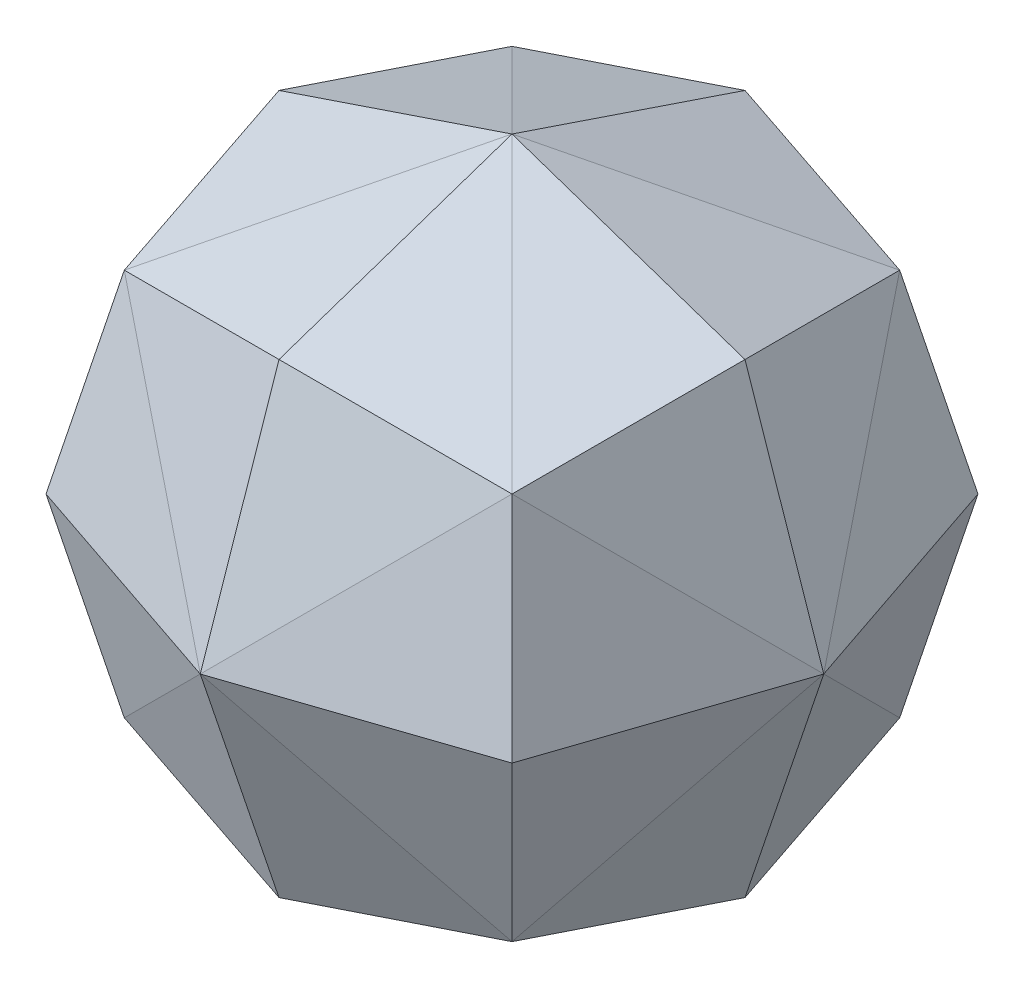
ISO-10303-21;
HEADER;
FILE_DESCRIPTION(('STEP AP214'),'2;1');
FILE_NAME('part.step','',(''),(''),'','','');
FILE_SCHEMA(('AUTOMOTIVE_DESIGN { 1 0 10303 214 1 1 1 1 }'));
ENDSEC;
DATA;
#1=APPLICATION_CONTEXT('core data for automotive mechanical design processes');
#2=APPLICATION_PROTOCOL_DEFINITION('international standard','automotive_design',2000,#1);
#3=PRODUCT_CONTEXT('',#1,'mechanical');
#4=PRODUCT('Part','Part','',(#3));
#5=PRODUCT_RELATED_PRODUCT_CATEGORY('part','',(#4));
#6=PRODUCT_DEFINITION_FORMATION('','',#4);
#7=PRODUCT_DEFINITION_CONTEXT('part definition',#1,'design');
#8=PRODUCT_DEFINITION('design','',#6,#7);
#9=PRODUCT_DEFINITION_SHAPE('','',#8);
#10=(LENGTH_UNIT() NAMED_UNIT(*) SI_UNIT(.MILLI.,.METRE.));
#11=(NAMED_UNIT(*) PLANE_ANGLE_UNIT() SI_UNIT($,.RADIAN.));
#12=(NAMED_UNIT(*) SI_UNIT($,.STERADIAN.) SOLID_ANGLE_UNIT());
#13=UNCERTAINTY_MEASURE_WITH_UNIT(LENGTH_MEASURE(1.E-05),#10,'distance_accuracy_value','');
#14=(GEOMETRIC_REPRESENTATION_CONTEXT(3) GLOBAL_UNCERTAINTY_ASSIGNED_CONTEXT((#13)) GLOBAL_UNIT_ASSIGNED_CONTEXT((#10,
#11,#12)) REPRESENTATION_CONTEXT('',''));
#15=CARTESIAN_POINT('',(0.,0.,0.));
#16=DIRECTION('',(0.,0.,1.));
#17=DIRECTION('',(1.,0.,0.));
#18=AXIS2_PLACEMENT_3D('',#15,#16,#17);
#19=CARTESIAN_POINT('',(33.8643142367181,-11.4466851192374,9.15237323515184));
#20=DIRECTION('',(0.91774074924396,-0.310211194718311,0.248034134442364));
#21=DIRECTION('',(0.320217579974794,0.947344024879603,0.));
#22=AXIS2_PLACEMENT_3D('',#19,#20,#21);
#23=PLANE('',#22);
#24=DIRECTION('',(0.194221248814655,-0.194221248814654,-0.961538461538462));
#25=VECTOR('',#24,1.);
#26=CARTESIAN_POINT('',(27.5248762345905,-27.5248762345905,12.5));
#27=LINE('',#26,#25);
#28=CARTESIAN_POINT('',(25.,-25.,25.));
#29=VERTEX_POINT('',#28);
#30=CARTESIAN_POINT('',(30.049752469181,-30.049752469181,0.));
#31=VERTEX_POINT('',#30);
#32=EDGE_CURVE('E1352',#29,#31,#27,.T.);
#33=ORIENTED_EDGE('',*,*,#32,.T.);
#34=DIRECTION('',(0.320217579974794,0.947344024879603,0.));
#35=VECTOR('',#34,1.);
#36=CARTESIAN_POINT('',(35.1284032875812,-15.0248762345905,0.));
#37=LINE('',#36,#35);
#38=CARTESIAN_POINT('',(40.2070541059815,0.,0.));
#39=VERTEX_POINT('',#38);
#40=EDGE_CURVE('E1354',#31,#39,#37,.T.);
#41=ORIENTED_EDGE('',*,*,#40,.T.);
#42=DIRECTION('',(-0.395121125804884,-0.649568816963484,0.649568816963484));
#43=VECTOR('',#42,1.);
#44=CARTESIAN_POINT('',(32.6035270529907,-12.5,12.5));
#45=LINE('',#44,#43);
#46=EDGE_CURVE('E1055',#39,#29,#45,.T.);
#47=ORIENTED_EDGE('',*,*,#46,.T.);
#48=EDGE_LOOP('',(#33,#41,#47));
#49=FACE_BOUND('',#48,.T.);
#50=ADVANCED_FACE('F1052',(#49),#23,.T.);
#51=CARTESIAN_POINT('',(33.8643142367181,-11.4466851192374,-9.15237323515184));
#52=DIRECTION('',(-0.91774074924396,0.310211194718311,0.248034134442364));
#53=DIRECTION('',(-0.320217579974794,-0.947344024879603,0.));
#54=AXIS2_PLACEMENT_3D('',#51,#52,#53);
#55=PLANE('',#54);
#56=DIRECTION('',(0.395121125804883,0.649568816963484,0.649568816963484));
#57=VECTOR('',#56,1.);
#58=CARTESIAN_POINT('',(32.6035270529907,-12.5,-12.5));
#59=LINE('',#58,#57);
#60=CARTESIAN_POINT('',(25.,-25.,-25.));
#61=VERTEX_POINT('',#60);
#62=EDGE_CURVE('E1343',#61,#39,#59,.T.);
#63=ORIENTED_EDGE('',*,*,#62,.T.);
#64=ORIENTED_EDGE('',*,*,#40,.F.);
#65=DIRECTION('',(-0.194221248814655,0.194221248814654,-0.961538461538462));
#66=VECTOR('',#65,1.);
#67=CARTESIAN_POINT('',(27.5248762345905,-27.5248762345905,-12.5));
#68=LINE('',#67,#66);
#69=EDGE_CURVE('E1332',#31,#61,#68,.T.);
#70=ORIENTED_EDGE('',*,*,#69,.T.);
#71=EDGE_LOOP('',(#63,#64,#70));
#72=FACE_BOUND('',#71,.T.);
#73=ADVANCED_FACE('F1388',(#72),#55,.F.);
#74=CARTESIAN_POINT('',(-33.8643142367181,11.4466851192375,9.15237323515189));
#75=DIRECTION('',(-0.917740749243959,0.310211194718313,0.248034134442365));
#76=DIRECTION('',(-0.320217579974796,-0.947344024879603,0.));
#77=AXIS2_PLACEMENT_3D('',#74,#75,#76);
#78=PLANE('',#77);
#79=DIRECTION('',(-0.395121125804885,-0.649568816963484,-0.649568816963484));
#80=VECTOR('',#79,1.);
#81=CARTESIAN_POINT('',(-32.6035270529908,12.5,12.5));
#82=LINE('',#81,#80);
#83=CARTESIAN_POINT('',(-25.,25.,25.));
#84=VERTEX_POINT('',#83);
#85=CARTESIAN_POINT('',(-40.2070541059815,0.,0.));
#86=VERTEX_POINT('',#85);
#87=EDGE_CURVE('E1341',#84,#86,#82,.T.);
#88=ORIENTED_EDGE('',*,*,#87,.F.);
#89=DIRECTION('',(0.194221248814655,-0.194221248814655,0.961538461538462));
#90=VECTOR('',#89,1.);
#91=CARTESIAN_POINT('',(-27.5248762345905,27.5248762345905,12.5));
#92=LINE('',#91,#90);
#93=CARTESIAN_POINT('',(-30.049752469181,30.049752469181,0.));
#94=VERTEX_POINT('',#93);
#95=EDGE_CURVE('E1338',#94,#84,#92,.T.);
#96=ORIENTED_EDGE('',*,*,#95,.F.);
#97=DIRECTION('',(-0.320217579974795,-0.947344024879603,0.));
#98=VECTOR('',#97,1.);
#99=CARTESIAN_POINT('',(-35.1284032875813,15.0248762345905,0.));
#100=LINE('',#99,#98);
#101=EDGE_CURVE('E13',#94,#86,#100,.T.);
#102=ORIENTED_EDGE('',*,*,#101,.T.);
#103=EDGE_LOOP('',(#88,#96,#102));
#104=FACE_BOUND('',#103,.T.);
#105=ADVANCED_FACE('F1422',(#104),#78,.T.);
#106=CARTESIAN_POINT('',(-33.8643142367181,11.4466851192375,-9.15237323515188));
#107=DIRECTION('',(0.91774074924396,-0.310211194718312,0.248034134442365));
#108=DIRECTION('',(0.320217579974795,0.947344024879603,0.));
#109=AXIS2_PLACEMENT_3D('',#106,#107,#108);
#110=PLANE('',#109);
#111=DIRECTION('',(-0.194221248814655,0.194221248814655,0.961538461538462));
#112=VECTOR('',#111,1.);
#113=CARTESIAN_POINT('',(-27.5248762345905,27.5248762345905,-12.5));
#114=LINE('',#113,#112);
#115=CARTESIAN_POINT('',(-25.,25.,-25.));
#116=VERTEX_POINT('',#115);
#117=EDGE_CURVE('E1350',#116,#94,#114,.T.);
#118=ORIENTED_EDGE('',*,*,#117,.F.);
#119=DIRECTION('',(0.395121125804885,0.649568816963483,-0.649568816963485));
#120=VECTOR('',#119,1.);
#121=CARTESIAN_POINT('',(-32.6035270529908,12.5,-12.5));
#122=LINE('',#121,#120);
#123=EDGE_CURVE('E1060',#86,#116,#122,.T.);
#124=ORIENTED_EDGE('',*,*,#123,.F.);
#125=ORIENTED_EDGE('',*,*,#101,.F.);
#126=EDGE_LOOP('',(#118,#124,#125));
#127=FACE_BOUND('',#126,.T.);
#128=ADVANCED_FACE('F1426',(#127),#110,.F.);
#129=CARTESIAN_POINT('',(-11.4466851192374,33.8643142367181,9.15237323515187));
#130=DIRECTION('',(0.310211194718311,-0.91774074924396,-0.248034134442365));
#131=DIRECTION('',(0.947344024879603,0.320217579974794,0.));
#132=AXIS2_PLACEMENT_3D('',#129,#130,#131);
#133=PLANE('',#132);
#134=DIRECTION('',(-0.649568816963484,-0.395121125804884,0.649568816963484));
#135=VECTOR('',#134,1.);
#136=CARTESIAN_POINT('',(-12.5,32.6035270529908,12.5));
#137=LINE('',#136,#135);
#138=CARTESIAN_POINT('',(0.,40.2070541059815,0.));
#139=VERTEX_POINT('',#138);
#140=EDGE_CURVE('E1160',#139,#84,#137,.T.);
#141=ORIENTED_EDGE('',*,*,#140,.F.);
#142=DIRECTION('',(0.947344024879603,0.320217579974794,0.));
#143=VECTOR('',#142,1.);
#144=CARTESIAN_POINT('',(-15.0248762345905,35.1284032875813,0.));
#145=LINE('',#144,#143);
#146=EDGE_CURVE('E1329',#94,#139,#145,.T.);
#147=ORIENTED_EDGE('',*,*,#146,.F.);
#148=ORIENTED_EDGE('',*,*,#95,.T.);
#149=EDGE_LOOP('',(#141,#147,#148));
#150=FACE_BOUND('',#149,.T.);
#151=ADVANCED_FACE('F1475',(#150),#133,.F.);
#152=CARTESIAN_POINT('',(11.4466851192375,-33.8643142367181,-9.15237323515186));
#153=DIRECTION('',(-0.310211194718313,0.917740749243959,0.248034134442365));
#154=DIRECTION('',(-0.947344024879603,-0.320217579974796,0.));
#155=AXIS2_PLACEMENT_3D('',#152,#153,#154);
#156=PLANE('',#155);
#157=DIRECTION('',(0.649568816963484,0.395121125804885,-0.649568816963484));
#158=VECTOR('',#157,1.);
#159=CARTESIAN_POINT('',(12.5,-32.6035270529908,-12.5));
#160=LINE('',#159,#158);
#161=CARTESIAN_POINT('',(0.,-40.2070541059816,0.));
#162=VERTEX_POINT('',#161);
#163=EDGE_CURVE('E1334',#162,#61,#160,.T.);
#164=ORIENTED_EDGE('',*,*,#163,.T.);
#165=ORIENTED_EDGE('',*,*,#69,.F.);
#166=DIRECTION('',(-0.947344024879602,-0.320217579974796,0.));
#167=VECTOR('',#166,1.);
#168=CARTESIAN_POINT('',(15.0248762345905,-35.1284032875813,0.));
#169=LINE('',#168,#167);
#170=EDGE_CURVE('E1076',#31,#162,#169,.T.);
#171=ORIENTED_EDGE('',*,*,#170,.T.);
#172=EDGE_LOOP('',(#164,#165,#171));
#173=FACE_BOUND('',#172,.T.);
#174=ADVANCED_FACE('F1395',(#173),#156,.F.);
#175=CARTESIAN_POINT('',(11.4466851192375,-33.8643142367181,9.15237323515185));
#176=DIRECTION('',(-0.310211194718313,0.917740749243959,-0.248034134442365));
#177=DIRECTION('',(-0.947344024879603,-0.320217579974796,0.));
#178=AXIS2_PLACEMENT_3D('',#175,#176,#177);
#179=PLANE('',#178);
#180=ORIENTED_EDGE('',*,*,#170,.F.);
#181=ORIENTED_EDGE('',*,*,#32,.F.);
#182=DIRECTION('',(-0.649568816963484,-0.395121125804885,-0.649568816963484));
#183=VECTOR('',#182,1.);
#184=CARTESIAN_POINT('',(12.5,-32.6035270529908,12.5));
#185=LINE('',#184,#183);
#186=EDGE_CURVE('E1311',#29,#162,#185,.T.);
#187=ORIENTED_EDGE('',*,*,#186,.T.);
#188=EDGE_LOOP('',(#180,#181,#187));
#189=FACE_BOUND('',#188,.T.);
#190=ADVANCED_FACE('F1363',(#189),#179,.F.);
#191=CARTESIAN_POINT('',(-11.4466851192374,33.8643142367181,-9.15237323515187));
#192=DIRECTION('',(0.310211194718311,-0.91774074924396,0.248034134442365));
#193=DIRECTION('',(0.947344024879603,0.320217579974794,0.));
#194=AXIS2_PLACEMENT_3D('',#191,#192,#193);
#195=PLANE('',#194);
#196=ORIENTED_EDGE('',*,*,#146,.T.);
#197=DIRECTION('',(0.649568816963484,0.395121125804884,0.649568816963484));
#198=VECTOR('',#197,1.);
#199=CARTESIAN_POINT('',(-12.5,32.6035270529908,-12.5));
#200=LINE('',#199,#198);
#201=EDGE_CURVE('E1326',#116,#139,#200,.T.);
#202=ORIENTED_EDGE('',*,*,#201,.F.);
#203=ORIENTED_EDGE('',*,*,#117,.T.);
#204=EDGE_LOOP('',(#196,#202,#203));
#205=FACE_BOUND('',#204,.T.);
#206=ADVANCED_FACE('F1429',(#205),#195,.F.);
#207=CARTESIAN_POINT('',(-33.8643142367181,-11.4466851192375,-9.15237323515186));
#208=DIRECTION('',(0.91774074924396,0.310211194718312,0.248034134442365));
#209=DIRECTION('',(-0.320217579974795,0.947344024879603,0.));
#210=AXIS2_PLACEMENT_3D('',#207,#208,#209);
#211=PLANE('',#210);
#212=DIRECTION('',(0.395121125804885,-0.649568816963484,-0.649568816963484));
#213=VECTOR('',#212,1.);
#214=CARTESIAN_POINT('',(-32.6035270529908,-12.5,-12.5));
#215=LINE('',#214,#213);
#216=CARTESIAN_POINT('',(-25.,-25.,-25.));
#217=VERTEX_POINT('',#216);
#218=EDGE_CURVE('E1318',#86,#217,#215,.T.);
#219=ORIENTED_EDGE('',*,*,#218,.T.);
#220=DIRECTION('',(-0.194221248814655,-0.194221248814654,0.961538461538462));
#221=VECTOR('',#220,1.);
#222=CARTESIAN_POINT('',(-27.5248762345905,-27.5248762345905,-12.5));
#223=LINE('',#222,#221);
#224=CARTESIAN_POINT('',(-30.049752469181,-30.049752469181,0.));
#225=VERTEX_POINT('',#224);
#226=EDGE_CURVE('E1321',#217,#225,#223,.T.);
#227=ORIENTED_EDGE('',*,*,#226,.T.);
#228=DIRECTION('',(-0.320217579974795,0.947344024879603,0.));
#229=VECTOR('',#228,1.);
#230=CARTESIAN_POINT('',(-35.1284032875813,-15.0248762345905,0.));
#231=LINE('',#230,#229);
#232=EDGE_CURVE('E1303',#225,#86,#231,.T.);
#233=ORIENTED_EDGE('',*,*,#232,.T.);
#234=EDGE_LOOP('',(#219,#227,#233));
#235=FACE_BOUND('',#234,.T.);
#236=ADVANCED_FACE('F1409',(#235),#211,.F.);
#237=CARTESIAN_POINT('',(33.8643142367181,11.4466851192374,9.15237323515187));
#238=DIRECTION('',(-0.91774074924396,-0.31021119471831,-0.248034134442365));
#239=DIRECTION('',(0.320217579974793,-0.947344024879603,0.));
#240=AXIS2_PLACEMENT_3D('',#237,#238,#239);
#241=PLANE('',#240);
#242=DIRECTION('',(-0.395121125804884,0.649568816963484,0.649568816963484));
#243=VECTOR('',#242,1.);
#244=CARTESIAN_POINT('',(32.6035270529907,12.5,12.5));
#245=LINE('',#244,#243);
#246=CARTESIAN_POINT('',(25.,25.,25.));
#247=VERTEX_POINT('',#246);
#248=EDGE_CURVE('E1315',#39,#247,#245,.T.);
#249=ORIENTED_EDGE('',*,*,#248,.F.);
#250=DIRECTION('',(0.320217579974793,-0.947344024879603,0.));
#251=VECTOR('',#250,1.);
#252=CARTESIAN_POINT('',(35.1284032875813,15.0248762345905,0.));
#253=LINE('',#252,#251);
#254=CARTESIAN_POINT('',(30.049752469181,30.049752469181,0.));
#255=VERTEX_POINT('',#254);
#256=EDGE_CURVE('E1312',#255,#39,#253,.T.);
#257=ORIENTED_EDGE('',*,*,#256,.F.);
#258=DIRECTION('',(0.194221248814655,0.194221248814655,-0.961538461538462));
#259=VECTOR('',#258,1.);
#260=CARTESIAN_POINT('',(27.5248762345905,27.5248762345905,12.5));
#261=LINE('',#260,#259);
#262=EDGE_CURVE('E1309',#247,#255,#261,.T.);
#263=ORIENTED_EDGE('',*,*,#262,.F.);
#264=EDGE_LOOP('',(#249,#257,#263));
#265=FACE_BOUND('',#264,.T.);
#266=ADVANCED_FACE('F1385',(#265),#241,.F.);
#267=CARTESIAN_POINT('',(33.8643142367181,11.4466851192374,-9.15237323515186));
#268=DIRECTION('',(-0.91774074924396,-0.31021119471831,0.248034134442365));
#269=DIRECTION('',(0.320217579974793,-0.947344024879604,0.));
#270=AXIS2_PLACEMENT_3D('',#267,#268,#269);
#271=PLANE('',#270);
#272=ORIENTED_EDGE('',*,*,#256,.T.);
#273=DIRECTION('',(0.395121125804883,-0.649568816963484,0.649568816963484));
#274=VECTOR('',#273,1.);
#275=CARTESIAN_POINT('',(32.6035270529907,12.5,-12.5));
#276=LINE('',#275,#274);
#277=CARTESIAN_POINT('',(25.,25.,-25.));
#278=VERTEX_POINT('',#277);
#279=EDGE_CURVE('E1304',#278,#39,#276,.T.);
#280=ORIENTED_EDGE('',*,*,#279,.F.);
#281=DIRECTION('',(-0.194221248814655,-0.194221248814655,-0.961538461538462));
#282=VECTOR('',#281,1.);
#283=CARTESIAN_POINT('',(27.5248762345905,27.5248762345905,-12.5));
#284=LINE('',#283,#282);
#285=EDGE_CURVE('E1300',#255,#278,#284,.T.);
#286=ORIENTED_EDGE('',*,*,#285,.F.);
#287=EDGE_LOOP('',(#272,#280,#286));
#288=FACE_BOUND('',#287,.T.);
#289=ADVANCED_FACE('F1454',(#288),#271,.F.);
#290=CARTESIAN_POINT('',(-33.8643142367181,-11.4466851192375,9.15237323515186));
#291=DIRECTION('',(0.917740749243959,0.310211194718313,-0.248034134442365));
#292=DIRECTION('',(-0.320217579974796,0.947344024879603,0.));
#293=AXIS2_PLACEMENT_3D('',#290,#291,#292);
#294=PLANE('',#293);
#295=ORIENTED_EDGE('',*,*,#232,.F.);
#296=DIRECTION('',(0.194221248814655,0.194221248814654,0.961538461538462));
#297=VECTOR('',#296,1.);
#298=CARTESIAN_POINT('',(-27.5248762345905,-27.5248762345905,12.5));
#299=LINE('',#298,#297);
#300=CARTESIAN_POINT('',(-25.,-25.,25.));
#301=VERTEX_POINT('',#300);
#302=EDGE_CURVE('E1306',#225,#301,#299,.T.);
#303=ORIENTED_EDGE('',*,*,#302,.T.);
#304=DIRECTION('',(-0.395121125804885,0.649568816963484,-0.649568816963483));
#305=VECTOR('',#304,1.);
#306=CARTESIAN_POINT('',(-32.6035270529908,-12.5,12.5));
#307=LINE('',#306,#305);
#308=EDGE_CURVE('E1068',#301,#86,#307,.T.);
#309=ORIENTED_EDGE('',*,*,#308,.T.);
#310=EDGE_LOOP('',(#295,#303,#309));
#311=FACE_BOUND('',#310,.T.);
#312=ADVANCED_FACE('F1411',(#311),#294,.F.);
#313=CARTESIAN_POINT('',(-11.4466851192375,-33.8643142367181,-9.15237323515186));
#314=DIRECTION('',(-0.310211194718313,-0.917740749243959,-0.248034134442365));
#315=DIRECTION('',(0.947344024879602,-0.320217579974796,0.));
#316=AXIS2_PLACEMENT_3D('',#313,#314,#315);
#317=PLANE('',#316);
#318=ORIENTED_EDGE('',*,*,#226,.F.);
#319=DIRECTION('',(0.649568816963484,-0.395121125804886,0.649568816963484));
#320=VECTOR('',#319,1.);
#321=CARTESIAN_POINT('',(-12.5,-32.6035270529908,-12.5));
#322=LINE('',#321,#320);
#323=EDGE_CURVE('E1295',#217,#162,#322,.T.);
#324=ORIENTED_EDGE('',*,*,#323,.T.);
#325=DIRECTION('',(-0.947344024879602,0.320217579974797,0.));
#326=VECTOR('',#325,1.);
#327=CARTESIAN_POINT('',(-15.0248762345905,-35.1284032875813,0.));
#328=LINE('',#327,#326);
#329=EDGE_CURVE('E1288',#162,#225,#328,.T.);
#330=ORIENTED_EDGE('',*,*,#329,.T.);
#331=EDGE_LOOP('',(#318,#324,#330));
#332=FACE_BOUND('',#331,.T.);
#333=ADVANCED_FACE('F1401',(#332),#317,.T.);
#334=CARTESIAN_POINT('',(11.4466851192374,33.8643142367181,9.15237323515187));
#335=DIRECTION('',(0.310211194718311,0.91774074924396,0.248034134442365));
#336=DIRECTION('',(-0.947344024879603,0.320217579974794,0.));
#337=AXIS2_PLACEMENT_3D('',#334,#335,#336);
#338=PLANE('',#337);
#339=DIRECTION('',(-0.649568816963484,0.395121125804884,-0.649568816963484));
#340=VECTOR('',#339,1.);
#341=CARTESIAN_POINT('',(12.5,32.6035270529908,12.5));
#342=LINE('',#341,#340);
#343=EDGE_CURVE('E1183',#247,#139,#342,.T.);
#344=ORIENTED_EDGE('',*,*,#343,.F.);
#345=ORIENTED_EDGE('',*,*,#262,.T.);
#346=DIRECTION('',(0.947344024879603,-0.320217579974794,0.));
#347=VECTOR('',#346,1.);
#348=CARTESIAN_POINT('',(15.0248762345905,35.1284032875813,0.));
#349=LINE('',#348,#347);
#350=EDGE_CURVE('E1291',#139,#255,#349,.T.);
#351=ORIENTED_EDGE('',*,*,#350,.F.);
#352=EDGE_LOOP('',(#344,#345,#351));
#353=FACE_BOUND('',#352,.T.);
#354=ADVANCED_FACE('F1437',(#353),#338,.T.);
#355=CARTESIAN_POINT('',(11.4466851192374,33.8643142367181,-9.15237323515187));
#356=DIRECTION('',(0.310211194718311,0.91774074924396,-0.248034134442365));
#357=DIRECTION('',(-0.947344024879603,0.320217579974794,0.));
#358=AXIS2_PLACEMENT_3D('',#355,#356,#357);
#359=PLANE('',#358);
#360=ORIENTED_EDGE('',*,*,#350,.T.);
#361=ORIENTED_EDGE('',*,*,#285,.T.);
#362=DIRECTION('',(0.649568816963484,-0.395121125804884,-0.649568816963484));
#363=VECTOR('',#362,1.);
#364=CARTESIAN_POINT('',(12.5,32.6035270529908,-12.5));
#365=LINE('',#364,#363);
#366=EDGE_CURVE('E1286',#139,#278,#365,.T.);
#367=ORIENTED_EDGE('',*,*,#366,.F.);
#368=EDGE_LOOP('',(#360,#361,#367));
#369=FACE_BOUND('',#368,.T.);
#370=ADVANCED_FACE('F1440',(#369),#359,.T.);
#371=CARTESIAN_POINT('',(-11.4466851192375,-33.8643142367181,9.15237323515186));
#372=DIRECTION('',(-0.310211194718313,-0.917740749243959,0.248034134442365));
#373=DIRECTION('',(0.947344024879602,-0.320217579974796,0.));
#374=AXIS2_PLACEMENT_3D('',#371,#372,#373);
#375=PLANE('',#374);
#376=ORIENTED_EDGE('',*,*,#329,.F.);
#377=DIRECTION('',(-0.649568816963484,0.395121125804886,0.649568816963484));
#378=VECTOR('',#377,1.);
#379=CARTESIAN_POINT('',(-12.5,-32.6035270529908,12.5));
#380=LINE('',#379,#378);
#381=EDGE_CURVE('E1277',#162,#301,#380,.T.);
#382=ORIENTED_EDGE('',*,*,#381,.T.);
#383=ORIENTED_EDGE('',*,*,#302,.F.);
#384=EDGE_LOOP('',(#376,#382,#383));
#385=FACE_BOUND('',#384,.T.);
#386=ADVANCED_FACE('F1404',(#385),#375,.T.);
#387=CARTESIAN_POINT('',(33.8643142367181,-9.15237323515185,11.4466851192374));
#388=DIRECTION('',(-0.91774074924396,0.248034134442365,-0.310211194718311));
#389=DIRECTION('',(-0.320217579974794,0.,0.947344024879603));
#390=AXIS2_PLACEMENT_3D('',#387,#388,#389);
#391=PLANE('',#390);
#392=ORIENTED_EDGE('',*,*,#46,.F.);
#393=DIRECTION('',(0.320217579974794,0.,-0.947344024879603));
#394=VECTOR('',#393,1.);
#395=CARTESIAN_POINT('',(35.1284032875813,0.,15.0248762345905));
#396=LINE('',#395,#394);
#397=CARTESIAN_POINT('',(30.049752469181,0.,30.049752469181));
#398=VERTEX_POINT('',#397);
#399=EDGE_CURVE('E1278',#398,#39,#396,.T.);
#400=ORIENTED_EDGE('',*,*,#399,.F.);
#401=DIRECTION('',(0.194221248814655,0.961538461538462,0.194221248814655));
#402=VECTOR('',#401,1.);
#403=CARTESIAN_POINT('',(27.5248762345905,-12.5,27.5248762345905));
#404=LINE('',#403,#402);
#405=EDGE_CURVE('E1274',#29,#398,#404,.T.);
#406=ORIENTED_EDGE('',*,*,#405,.F.);
#407=EDGE_LOOP('',(#392,#400,#406));
#408=FACE_BOUND('',#407,.T.);
#409=ADVANCED_FACE('F1376',(#408),#391,.F.);
#410=CARTESIAN_POINT('',(-33.8643142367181,9.15237323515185,-11.4466851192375));
#411=DIRECTION('',(-0.917740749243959,0.248034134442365,-0.310211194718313));
#412=DIRECTION('',(-0.320217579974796,0.,0.947344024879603));
#413=AXIS2_PLACEMENT_3D('',#410,#411,#412);
#414=PLANE('',#413);
#415=DIRECTION('',(-0.320217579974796,0.,0.947344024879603));
#416=VECTOR('',#415,1.);
#417=CARTESIAN_POINT('',(-35.1284032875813,0.,-15.0248762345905));
#418=LINE('',#417,#416);
#419=CARTESIAN_POINT('',(-30.049752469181,0.,-30.049752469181));
#420=VERTEX_POINT('',#419);
#421=EDGE_CURVE('E1281',#420,#86,#418,.T.);
#422=ORIENTED_EDGE('',*,*,#421,.T.);
#423=ORIENTED_EDGE('',*,*,#123,.T.);
#424=DIRECTION('',(-0.194221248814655,-0.961538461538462,-0.194221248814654));
#425=VECTOR('',#424,1.);
#426=CARTESIAN_POINT('',(-27.5248762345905,12.5,-27.5248762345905));
#427=LINE('',#426,#425);
#428=EDGE_CURVE('E1271',#116,#420,#427,.T.);
#429=ORIENTED_EDGE('',*,*,#428,.T.);
#430=EDGE_LOOP('',(#422,#423,#429));
#431=FACE_BOUND('',#430,.T.);
#432=ADVANCED_FACE('F1414',(#431),#414,.T.);
#433=CARTESIAN_POINT('',(-33.8643142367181,-9.15237323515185,-11.4466851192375));
#434=DIRECTION('',(0.91774074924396,0.248034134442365,0.310211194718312));
#435=DIRECTION('',(0.320217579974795,0.,-0.947344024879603));
#436=AXIS2_PLACEMENT_3D('',#433,#434,#435);
#437=PLANE('',#436);
#438=ORIENTED_EDGE('',*,*,#421,.F.);
#439=DIRECTION('',(0.194221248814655,-0.961538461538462,0.194221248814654));
#440=VECTOR('',#439,1.);
#441=CARTESIAN_POINT('',(-27.5248762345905,-12.5,-27.5248762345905));
#442=LINE('',#441,#440);
#443=EDGE_CURVE('E1261',#420,#217,#442,.T.);
#444=ORIENTED_EDGE('',*,*,#443,.T.);
#445=ORIENTED_EDGE('',*,*,#218,.F.);
#446=EDGE_LOOP('',(#438,#444,#445));
#447=FACE_BOUND('',#446,.T.);
#448=ADVANCED_FACE('F1538',(#447),#437,.F.);
#449=CARTESIAN_POINT('',(33.8643142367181,9.15237323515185,11.4466851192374));
#450=DIRECTION('',(-0.91774074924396,-0.248034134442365,-0.310211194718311));
#451=DIRECTION('',(-0.320217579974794,0.,0.947344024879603));
#452=AXIS2_PLACEMENT_3D('',#449,#450,#451);
#453=PLANE('',#452);
#454=ORIENTED_EDGE('',*,*,#399,.T.);
#455=ORIENTED_EDGE('',*,*,#248,.T.);
#456=DIRECTION('',(-0.194221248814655,0.961538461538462,-0.194221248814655));
#457=VECTOR('',#456,1.);
#458=CARTESIAN_POINT('',(27.5248762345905,12.5,27.5248762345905));
#459=LINE('',#458,#457);
#460=EDGE_CURVE('E1268',#398,#247,#459,.T.);
#461=ORIENTED_EDGE('',*,*,#460,.F.);
#462=EDGE_LOOP('',(#454,#455,#461));
#463=FACE_BOUND('',#462,.T.);
#464=ADVANCED_FACE('F1380',(#463),#453,.F.);
#465=CARTESIAN_POINT('',(11.4466851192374,9.15237323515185,33.8643142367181));
#466=DIRECTION('',(-0.310211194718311,-0.248034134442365,-0.91774074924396));
#467=DIRECTION('',(-0.947344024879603,0.,0.320217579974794));
#468=AXIS2_PLACEMENT_3D('',#465,#466,#467);
#469=PLANE('',#468);
#470=ORIENTED_EDGE('',*,*,#460,.T.);
#471=DIRECTION('',(0.649568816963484,0.649568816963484,-0.395121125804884));
#472=VECTOR('',#471,1.);
#473=CARTESIAN_POINT('',(12.5,12.5,32.6035270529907));
#474=LINE('',#473,#472);
#475=CARTESIAN_POINT('',(0.,0.,40.2070541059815));
#476=VERTEX_POINT('',#475);
#477=EDGE_CURVE('E1175',#476,#247,#474,.T.);
#478=ORIENTED_EDGE('',*,*,#477,.F.);
#479=DIRECTION('',(-0.947344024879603,0.,0.320217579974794));
#480=VECTOR('',#479,1.);
#481=CARTESIAN_POINT('',(15.0248762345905,0.,35.1284032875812));
#482=LINE('',#481,#480);
#483=EDGE_CURVE('E1258',#398,#476,#482,.T.);
#484=ORIENTED_EDGE('',*,*,#483,.F.);
#485=EDGE_LOOP('',(#470,#478,#484));
#486=FACE_BOUND('',#485,.T.);
#487=ADVANCED_FACE('F1379',(#486),#469,.F.);
#488=CARTESIAN_POINT('',(-11.4466851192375,-9.15237323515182,-33.8643142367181));
#489=DIRECTION('',(-0.310211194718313,-0.248034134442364,-0.91774074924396));
#490=DIRECTION('',(-0.947344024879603,0.,0.320217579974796));
#491=AXIS2_PLACEMENT_3D('',#488,#489,#490);
#492=PLANE('',#491);
#493=ORIENTED_EDGE('',*,*,#443,.F.);
#494=DIRECTION('',(0.947344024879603,0.,-0.320217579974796));
#495=VECTOR('',#494,1.);
#496=CARTESIAN_POINT('',(-15.0248762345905,0.,-35.1284032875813));
#497=LINE('',#496,#495);
#498=CARTESIAN_POINT('',(0.,0.,-40.2070541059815));
#499=VERTEX_POINT('',#498);
#500=EDGE_CURVE('E1263',#420,#499,#497,.T.);
#501=ORIENTED_EDGE('',*,*,#500,.T.);
#502=DIRECTION('',(-0.649568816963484,-0.649568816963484,0.395121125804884));
#503=VECTOR('',#502,1.);
#504=CARTESIAN_POINT('',(-12.5,-12.5,-32.6035270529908));
#505=LINE('',#504,#503);
#506=EDGE_CURVE('E1255',#499,#217,#505,.T.);
#507=ORIENTED_EDGE('',*,*,#506,.T.);
#508=EDGE_LOOP('',(#493,#501,#507));
#509=FACE_BOUND('',#508,.T.);
#510=ADVANCED_FACE('F1561',(#509),#492,.T.);
#511=CARTESIAN_POINT('',(-11.4466851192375,9.15237323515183,-33.8643142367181));
#512=DIRECTION('',(-0.310211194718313,0.248034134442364,-0.91774074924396));
#513=DIRECTION('',(-0.947344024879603,0.,0.320217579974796));
#514=AXIS2_PLACEMENT_3D('',#511,#512,#513);
#515=PLANE('',#514);
#516=ORIENTED_EDGE('',*,*,#428,.F.);
#517=DIRECTION('',(0.649568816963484,-0.649568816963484,-0.395121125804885));
#518=VECTOR('',#517,1.);
#519=CARTESIAN_POINT('',(-12.5,12.5,-32.6035270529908));
#520=LINE('',#519,#518);
#521=EDGE_CURVE('E1243',#116,#499,#520,.T.);
#522=ORIENTED_EDGE('',*,*,#521,.T.);
#523=ORIENTED_EDGE('',*,*,#500,.F.);
#524=EDGE_LOOP('',(#516,#522,#523));
#525=FACE_BOUND('',#524,.T.);
#526=ADVANCED_FACE('F1570',(#525),#515,.T.);
#527=CARTESIAN_POINT('',(11.4466851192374,-9.15237323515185,33.8643142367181));
#528=DIRECTION('',(0.310211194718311,-0.248034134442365,0.91774074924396));
#529=DIRECTION('',(0.947344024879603,0.,-0.320217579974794));
#530=AXIS2_PLACEMENT_3D('',#527,#528,#529);
#531=PLANE('',#530);
#532=ORIENTED_EDGE('',*,*,#405,.T.);
#533=ORIENTED_EDGE('',*,*,#483,.T.);
#534=DIRECTION('',(-0.649568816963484,0.649568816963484,0.395121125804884));
#535=VECTOR('',#534,1.);
#536=CARTESIAN_POINT('',(12.5,-12.5,32.6035270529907));
#537=LINE('',#536,#535);
#538=EDGE_CURVE('E1252',#29,#476,#537,.T.);
#539=ORIENTED_EDGE('',*,*,#538,.F.);
#540=EDGE_LOOP('',(#532,#533,#539));
#541=FACE_BOUND('',#540,.T.);
#542=ADVANCED_FACE('F1374',(#541),#531,.T.);
#543=CARTESIAN_POINT('',(-9.15237323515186,-33.8643142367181,11.4466851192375));
#544=DIRECTION('',(0.248034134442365,0.917740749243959,-0.310211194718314));
#545=DIRECTION('',(0.,0.320217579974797,0.947344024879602));
#546=AXIS2_PLACEMENT_3D('',#543,#544,#545);
#547=PLANE('',#546);
#548=ORIENTED_EDGE('',*,*,#381,.F.);
#549=DIRECTION('',(0.,-0.320217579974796,-0.947344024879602));
#550=VECTOR('',#549,1.);
#551=CARTESIAN_POINT('',(0.,-35.1284032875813,15.0248762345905));
#552=LINE('',#551,#550);
#553=CARTESIAN_POINT('',(0.,-30.049752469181,30.049752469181));
#554=VERTEX_POINT('',#553);
#555=EDGE_CURVE('E1244',#554,#162,#552,.T.);
#556=ORIENTED_EDGE('',*,*,#555,.F.);
#557=DIRECTION('',(0.961538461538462,-0.194221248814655,0.194221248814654));
#558=VECTOR('',#557,1.);
#559=CARTESIAN_POINT('',(-12.5,-27.5248762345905,27.5248762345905));
#560=LINE('',#559,#558);
#561=EDGE_CURVE('E1240',#301,#554,#560,.T.);
#562=ORIENTED_EDGE('',*,*,#561,.F.);
#563=EDGE_LOOP('',(#548,#556,#562));
#564=FACE_BOUND('',#563,.T.);
#565=ADVANCED_FACE('F1578',(#564),#547,.F.);
#566=CARTESIAN_POINT('',(9.15237323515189,33.8643142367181,-11.4466851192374));
#567=DIRECTION('',(-0.248034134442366,-0.91774074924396,0.310211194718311));
#568=DIRECTION('',(0.,-0.320217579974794,-0.947344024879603));
#569=AXIS2_PLACEMENT_3D('',#566,#567,#568);
#570=PLANE('',#569);
#571=ORIENTED_EDGE('',*,*,#366,.T.);
#572=DIRECTION('',(-0.961538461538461,0.194221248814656,-0.194221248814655));
#573=VECTOR('',#572,1.);
#574=CARTESIAN_POINT('',(12.5,27.5248762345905,-27.5248762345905));
#575=LINE('',#574,#573);
#576=CARTESIAN_POINT('',(0.,30.049752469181,-30.049752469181));
#577=VERTEX_POINT('',#576);
#578=EDGE_CURVE('E1247',#278,#577,#575,.T.);
#579=ORIENTED_EDGE('',*,*,#578,.T.);
#580=DIRECTION('',(0.,0.320217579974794,0.947344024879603));
#581=VECTOR('',#580,1.);
#582=CARTESIAN_POINT('',(0.,35.1284032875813,-15.0248762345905));
#583=LINE('',#582,#581);
#584=EDGE_CURVE('E1237',#577,#139,#583,.T.);
#585=ORIENTED_EDGE('',*,*,#584,.T.);
#586=EDGE_LOOP('',(#571,#579,#585));
#587=FACE_BOUND('',#586,.T.);
#588=ADVANCED_FACE('F1443',(#587),#570,.F.);
#589=CARTESIAN_POINT('',(-9.15237323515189,33.8643142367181,-11.4466851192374));
#590=DIRECTION('',(0.248034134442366,-0.91774074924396,0.310211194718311));
#591=DIRECTION('',(0.,-0.320217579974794,-0.947344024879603));
#592=AXIS2_PLACEMENT_3D('',#589,#590,#591);
#593=PLANE('',#592);
#594=ORIENTED_EDGE('',*,*,#584,.F.);
#595=DIRECTION('',(-0.961538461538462,-0.194221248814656,0.194221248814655));
#596=VECTOR('',#595,1.);
#597=CARTESIAN_POINT('',(-12.5,27.5248762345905,-27.5248762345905));
#598=LINE('',#597,#596);
#599=EDGE_CURVE('E1231',#577,#116,#598,.T.);
#600=ORIENTED_EDGE('',*,*,#599,.T.);
#601=ORIENTED_EDGE('',*,*,#201,.T.);
#602=EDGE_LOOP('',(#594,#600,#601));
#603=FACE_BOUND('',#602,.T.);
#604=ADVANCED_FACE('F1433',(#603),#593,.F.);
#605=CARTESIAN_POINT('',(9.15237323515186,-33.8643142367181,11.4466851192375));
#606=DIRECTION('',(-0.248034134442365,0.917740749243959,-0.310211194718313));
#607=DIRECTION('',(0.,0.320217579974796,0.947344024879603));
#608=AXIS2_PLACEMENT_3D('',#605,#606,#607);
#609=PLANE('',#608);
#610=ORIENTED_EDGE('',*,*,#555,.T.);
#611=ORIENTED_EDGE('',*,*,#186,.F.);
#612=DIRECTION('',(0.961538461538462,0.194221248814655,-0.194221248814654));
#613=VECTOR('',#612,1.);
#614=CARTESIAN_POINT('',(12.5,-27.5248762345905,27.5248762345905));
#615=LINE('',#614,#613);
#616=EDGE_CURVE('E1234',#554,#29,#615,.T.);
#617=ORIENTED_EDGE('',*,*,#616,.F.);
#618=EDGE_LOOP('',(#610,#611,#617));
#619=FACE_BOUND('',#618,.T.);
#620=ADVANCED_FACE('F1372',(#619),#609,.F.);
#621=CARTESIAN_POINT('',(9.15237323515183,-11.4466851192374,33.8643142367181));
#622=DIRECTION('',(0.248034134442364,-0.310211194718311,0.91774074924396));
#623=DIRECTION('',(0.,-0.947344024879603,-0.320217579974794));
#624=AXIS2_PLACEMENT_3D('',#621,#622,#623);
#625=PLANE('',#624);
#626=DIRECTION('',(0.,0.947344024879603,0.320217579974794));
#627=VECTOR('',#626,1.);
#628=CARTESIAN_POINT('',(0.,-15.0248762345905,35.1284032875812));
#629=LINE('',#628,#627);
#630=EDGE_CURVE('E1228',#554,#476,#629,.T.);
#631=ORIENTED_EDGE('',*,*,#630,.F.);
#632=ORIENTED_EDGE('',*,*,#616,.T.);
#633=ORIENTED_EDGE('',*,*,#538,.T.);
#634=EDGE_LOOP('',(#631,#632,#633));
#635=FACE_BOUND('',#634,.T.);
#636=ADVANCED_FACE('F1368',(#635),#625,.T.);
#637=CARTESIAN_POINT('',(-9.15237323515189,11.4466851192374,-33.8643142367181));
#638=DIRECTION('',(-0.248034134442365,0.310211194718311,-0.91774074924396));
#639=DIRECTION('',(0.,0.947344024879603,0.320217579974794));
#640=AXIS2_PLACEMENT_3D('',#637,#638,#639);
#641=PLANE('',#640);
#642=ORIENTED_EDGE('',*,*,#599,.F.);
#643=DIRECTION('',(0.,-0.947344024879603,-0.320217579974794));
#644=VECTOR('',#643,1.);
#645=CARTESIAN_POINT('',(0.,15.0248762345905,-35.1284032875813));
#646=LINE('',#645,#644);
#647=EDGE_CURVE('E1225',#577,#499,#646,.T.);
#648=ORIENTED_EDGE('',*,*,#647,.T.);
#649=ORIENTED_EDGE('',*,*,#521,.F.);
#650=EDGE_LOOP('',(#642,#648,#649));
#651=FACE_BOUND('',#650,.T.);
#652=ADVANCED_FACE('F1712',(#651),#641,.T.);
#653=CARTESIAN_POINT('',(9.15237323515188,11.4466851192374,-33.8643142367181));
#654=DIRECTION('',(0.248034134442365,0.310211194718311,-0.91774074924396));
#655=DIRECTION('',(0.,0.947344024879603,0.320217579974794));
#656=AXIS2_PLACEMENT_3D('',#653,#654,#655);
#657=PLANE('',#656);
#658=ORIENTED_EDGE('',*,*,#578,.F.);
#659=DIRECTION('',(-0.649568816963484,-0.649568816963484,-0.395121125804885));
#660=VECTOR('',#659,1.);
#661=CARTESIAN_POINT('',(12.5,12.5,-32.6035270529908));
#662=LINE('',#661,#660);
#663=EDGE_CURVE('E1214',#278,#499,#662,.T.);
#664=ORIENTED_EDGE('',*,*,#663,.T.);
#665=ORIENTED_EDGE('',*,*,#647,.F.);
#666=EDGE_LOOP('',(#658,#664,#665));
#667=FACE_BOUND('',#666,.T.);
#668=ADVANCED_FACE('F1447',(#667),#657,.T.);
#669=CARTESIAN_POINT('',(-9.15237323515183,-11.4466851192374,33.8643142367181));
#670=DIRECTION('',(-0.248034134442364,-0.310211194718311,0.91774074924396));
#671=DIRECTION('',(0.,-0.947344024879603,-0.320217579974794));
#672=AXIS2_PLACEMENT_3D('',#669,#670,#671);
#673=PLANE('',#672);
#674=DIRECTION('',(0.649568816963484,0.649568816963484,0.395121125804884));
#675=VECTOR('',#674,1.);
#676=CARTESIAN_POINT('',(-12.5,-12.5,32.6035270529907));
#677=LINE('',#676,#675);
#678=EDGE_CURVE('E1223',#301,#476,#677,.T.);
#679=ORIENTED_EDGE('',*,*,#678,.F.);
#680=ORIENTED_EDGE('',*,*,#561,.T.);
#681=ORIENTED_EDGE('',*,*,#630,.T.);
#682=EDGE_LOOP('',(#679,#680,#681));
#683=FACE_BOUND('',#682,.T.);
#684=ADVANCED_FACE('F1705',(#683),#673,.T.);
#685=CARTESIAN_POINT('',(-11.4466851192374,-9.15237323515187,33.8643142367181));
#686=DIRECTION('',(0.31021119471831,0.248034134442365,-0.91774074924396));
#687=DIRECTION('',(-0.947344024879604,0.,-0.320217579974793));
#688=AXIS2_PLACEMENT_3D('',#685,#686,#687);
#689=PLANE('',#688);
#690=DIRECTION('',(-0.947344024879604,0.,-0.320217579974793));
#691=VECTOR('',#690,1.);
#692=CARTESIAN_POINT('',(-15.0248762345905,0.,35.1284032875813));
#693=LINE('',#692,#691);
#694=CARTESIAN_POINT('',(-30.049752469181,0.,30.049752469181));
#695=VERTEX_POINT('',#694);
#696=EDGE_CURVE('E1218',#476,#695,#693,.T.);
#697=ORIENTED_EDGE('',*,*,#696,.T.);
#698=DIRECTION('',(0.194221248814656,-0.961538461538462,-0.194221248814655));
#699=VECTOR('',#698,1.);
#700=CARTESIAN_POINT('',(-27.5248762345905,-12.5,27.5248762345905));
#701=LINE('',#700,#699);
#702=EDGE_CURVE('E1209',#695,#301,#701,.T.);
#703=ORIENTED_EDGE('',*,*,#702,.T.);
#704=ORIENTED_EDGE('',*,*,#678,.T.);
#705=EDGE_LOOP('',(#697,#703,#704));
#706=FACE_BOUND('',#705,.T.);
#707=ADVANCED_FACE('F1702',(#706),#689,.F.);
#708=CARTESIAN_POINT('',(11.4466851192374,9.15237323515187,-33.8643142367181));
#709=DIRECTION('',(-0.310211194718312,-0.248034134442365,0.91774074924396));
#710=DIRECTION('',(0.947344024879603,0.,0.320217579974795));
#711=AXIS2_PLACEMENT_3D('',#708,#709,#710);
#712=PLANE('',#711);
#713=DIRECTION('',(0.947344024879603,0.,0.320217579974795));
#714=VECTOR('',#713,1.);
#715=CARTESIAN_POINT('',(15.0248762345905,0.,-35.1284032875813));
#716=LINE('',#715,#714);
#717=CARTESIAN_POINT('',(30.049752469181,0.,-30.049752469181));
#718=VERTEX_POINT('',#717);
#719=EDGE_CURVE('E1215',#499,#718,#716,.T.);
#720=ORIENTED_EDGE('',*,*,#719,.F.);
#721=ORIENTED_EDGE('',*,*,#663,.F.);
#722=DIRECTION('',(-0.194221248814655,0.961538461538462,0.194221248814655));
#723=VECTOR('',#722,1.);
#724=CARTESIAN_POINT('',(27.5248762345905,12.5,-27.5248762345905));
#725=LINE('',#724,#723);
#726=EDGE_CURVE('E1211',#718,#278,#725,.T.);
#727=ORIENTED_EDGE('',*,*,#726,.F.);
#728=EDGE_LOOP('',(#720,#721,#727));
#729=FACE_BOUND('',#728,.T.);
#730=ADVANCED_FACE('F1450',(#729),#712,.F.);
#731=CARTESIAN_POINT('',(33.8643142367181,9.15237323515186,-11.4466851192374));
#732=DIRECTION('',(-0.91774074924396,-0.248034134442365,0.31021119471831));
#733=DIRECTION('',(0.320217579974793,0.,0.947344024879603));
#734=AXIS2_PLACEMENT_3D('',#731,#732,#733);
#735=PLANE('',#734);
#736=ORIENTED_EDGE('',*,*,#726,.T.);
#737=ORIENTED_EDGE('',*,*,#279,.T.);
#738=DIRECTION('',(0.320217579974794,0.,0.947344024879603));
#739=VECTOR('',#738,1.);
#740=CARTESIAN_POINT('',(35.1284032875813,0.,-15.0248762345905));
#741=LINE('',#740,#739);
#742=EDGE_CURVE('E1206',#718,#39,#741,.T.);
#743=ORIENTED_EDGE('',*,*,#742,.F.);
#744=EDGE_LOOP('',(#736,#737,#743));
#745=FACE_BOUND('',#744,.T.);
#746=ADVANCED_FACE('F1452',(#745),#735,.F.);
#747=CARTESIAN_POINT('',(-33.8643142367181,-9.1523732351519,11.4466851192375));
#748=DIRECTION('',(0.91774074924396,0.248034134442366,-0.310211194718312));
#749=DIRECTION('',(-0.320217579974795,0.,-0.947344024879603));
#750=AXIS2_PLACEMENT_3D('',#747,#748,#749);
#751=PLANE('',#750);
#752=ORIENTED_EDGE('',*,*,#308,.F.);
#753=ORIENTED_EDGE('',*,*,#702,.F.);
#754=DIRECTION('',(-0.320217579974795,0.,-0.947344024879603));
#755=VECTOR('',#754,1.);
#756=CARTESIAN_POINT('',(-35.1284032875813,0.,15.0248762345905));
#757=LINE('',#756,#755);
#758=EDGE_CURVE('E1203',#695,#86,#757,.T.);
#759=ORIENTED_EDGE('',*,*,#758,.T.);
#760=EDGE_LOOP('',(#752,#753,#759));
#761=FACE_BOUND('',#760,.T.);
#762=ADVANCED_FACE('F1694',(#761),#751,.F.);
#763=CARTESIAN_POINT('',(-33.8643142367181,9.1523732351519,11.4466851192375));
#764=DIRECTION('',(-0.917740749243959,0.248034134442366,0.310211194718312));
#765=DIRECTION('',(0.320217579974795,0.,0.947344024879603));
#766=AXIS2_PLACEMENT_3D('',#763,#764,#765);
#767=PLANE('',#766);
#768=DIRECTION('',(0.194221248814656,0.961538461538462,-0.194221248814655));
#769=VECTOR('',#768,1.);
#770=CARTESIAN_POINT('',(-27.5248762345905,12.5,27.5248762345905));
#771=LINE('',#770,#769);
#772=EDGE_CURVE('E1198',#695,#84,#771,.T.);
#773=ORIENTED_EDGE('',*,*,#772,.T.);
#774=ORIENTED_EDGE('',*,*,#87,.T.);
#775=ORIENTED_EDGE('',*,*,#758,.F.);
#776=EDGE_LOOP('',(#773,#774,#775));
#777=FACE_BOUND('',#776,.T.);
#778=ADVANCED_FACE('F1691',(#777),#767,.T.);
#779=CARTESIAN_POINT('',(33.8643142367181,-9.15237323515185,-11.4466851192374));
#780=DIRECTION('',(0.91774074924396,-0.248034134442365,-0.310211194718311));
#781=DIRECTION('',(-0.320217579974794,0.,-0.947344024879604));
#782=AXIS2_PLACEMENT_3D('',#779,#780,#781);
#783=PLANE('',#782);
#784=ORIENTED_EDGE('',*,*,#62,.F.);
#785=DIRECTION('',(-0.194221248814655,-0.961538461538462,0.194221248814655));
#786=VECTOR('',#785,1.);
#787=CARTESIAN_POINT('',(27.5248762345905,-12.5,-27.5248762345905));
#788=LINE('',#787,#786);
#789=EDGE_CURVE('E1200',#718,#61,#788,.T.);
#790=ORIENTED_EDGE('',*,*,#789,.F.);
#791=ORIENTED_EDGE('',*,*,#742,.T.);
#792=EDGE_LOOP('',(#784,#790,#791));
#793=FACE_BOUND('',#792,.T.);
#794=ADVANCED_FACE('F1391',(#793),#783,.T.);
#795=CARTESIAN_POINT('',(11.4466851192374,-9.15237323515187,-33.8643142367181));
#796=DIRECTION('',(-0.310211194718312,0.248034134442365,0.91774074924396));
#797=DIRECTION('',(0.947344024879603,0.,0.320217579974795));
#798=AXIS2_PLACEMENT_3D('',#795,#796,#797);
#799=PLANE('',#798);
#800=ORIENTED_EDGE('',*,*,#789,.T.);
#801=DIRECTION('',(0.649568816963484,-0.649568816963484,0.395121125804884));
#802=VECTOR('',#801,1.);
#803=CARTESIAN_POINT('',(12.5,-12.5,-32.6035270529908));
#804=LINE('',#803,#802);
#805=EDGE_CURVE('E1195',#499,#61,#804,.T.);
#806=ORIENTED_EDGE('',*,*,#805,.F.);
#807=ORIENTED_EDGE('',*,*,#719,.T.);
#808=EDGE_LOOP('',(#800,#806,#807));
#809=FACE_BOUND('',#808,.T.);
#810=ADVANCED_FACE('F1683',(#809),#799,.F.);
#811=CARTESIAN_POINT('',(-11.4466851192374,9.15237323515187,33.8643142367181));
#812=DIRECTION('',(0.31021119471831,-0.248034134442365,-0.91774074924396));
#813=DIRECTION('',(-0.947344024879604,0.,-0.320217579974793));
#814=AXIS2_PLACEMENT_3D('',#811,#812,#813);
#815=PLANE('',#814);
#816=DIRECTION('',(-0.649568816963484,0.649568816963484,-0.395121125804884));
#817=VECTOR('',#816,1.);
#818=CARTESIAN_POINT('',(-12.5,12.5,32.6035270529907));
#819=LINE('',#818,#817);
#820=EDGE_CURVE('E1177',#476,#84,#819,.T.);
#821=ORIENTED_EDGE('',*,*,#820,.T.);
#822=ORIENTED_EDGE('',*,*,#772,.F.);
#823=ORIENTED_EDGE('',*,*,#696,.F.);
#824=EDGE_LOOP('',(#821,#822,#823));
#825=FACE_BOUND('',#824,.T.);
#826=ADVANCED_FACE('F1621',(#825),#815,.F.);
#827=CARTESIAN_POINT('',(9.15237323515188,11.4466851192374,33.8643142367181));
#828=DIRECTION('',(-0.248034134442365,-0.31021119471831,-0.91774074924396));
#829=DIRECTION('',(0.,0.947344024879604,-0.320217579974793));
#830=AXIS2_PLACEMENT_3D('',#827,#828,#829);
#831=PLANE('',#830);
#832=DIRECTION('',(0.,0.947344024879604,-0.320217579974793));
#833=VECTOR('',#832,1.);
#834=CARTESIAN_POINT('',(0.,15.0248762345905,35.1284032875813));
#835=LINE('',#834,#833);
#836=CARTESIAN_POINT('',(0.,30.049752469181,30.049752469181));
#837=VERTEX_POINT('',#836);
#838=EDGE_CURVE('E1173',#476,#837,#835,.T.);
#839=ORIENTED_EDGE('',*,*,#838,.F.);
#840=ORIENTED_EDGE('',*,*,#477,.T.);
#841=DIRECTION('',(0.961538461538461,-0.194221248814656,-0.194221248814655));
#842=VECTOR('',#841,1.);
#843=CARTESIAN_POINT('',(12.5,27.5248762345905,27.5248762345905));
#844=LINE('',#843,#842);
#845=EDGE_CURVE('E1171',#837,#247,#844,.T.);
#846=ORIENTED_EDGE('',*,*,#845,.F.);
#847=EDGE_LOOP('',(#839,#840,#846));
#848=FACE_BOUND('',#847,.T.);
#849=ADVANCED_FACE('F1172',(#848),#831,.F.);
#850=CARTESIAN_POINT('',(-9.15237323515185,-11.4466851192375,-33.8643142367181));
#851=DIRECTION('',(0.248034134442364,0.310211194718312,0.91774074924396));
#852=DIRECTION('',(0.,-0.947344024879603,0.320217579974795));
#853=AXIS2_PLACEMENT_3D('',#850,#851,#852);
#854=PLANE('',#853);
#855=DIRECTION('',(0.,-0.947344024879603,0.320217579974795));
#856=VECTOR('',#855,1.);
#857=CARTESIAN_POINT('',(0.,-15.0248762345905,-35.1284032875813));
#858=LINE('',#857,#856);
#859=CARTESIAN_POINT('',(0.,-30.049752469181,-30.049752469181));
#860=VERTEX_POINT('',#859);
#861=EDGE_CURVE('E1180',#499,#860,#858,.T.);
#862=ORIENTED_EDGE('',*,*,#861,.T.);
#863=DIRECTION('',(-0.961538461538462,0.194221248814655,0.194221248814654));
#864=VECTOR('',#863,1.);
#865=CARTESIAN_POINT('',(-12.5,-27.5248762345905,-27.5248762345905));
#866=LINE('',#865,#864);
#867=EDGE_CURVE('E1164',#860,#217,#866,.T.);
#868=ORIENTED_EDGE('',*,*,#867,.T.);
#869=ORIENTED_EDGE('',*,*,#506,.F.);
#870=EDGE_LOOP('',(#862,#868,#869));
#871=FACE_BOUND('',#870,.T.);
#872=ADVANCED_FACE('F1620',(#871),#854,.F.);
#873=CARTESIAN_POINT('',(9.15237323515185,-11.4466851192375,-33.8643142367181));
#874=DIRECTION('',(0.248034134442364,-0.310211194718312,-0.91774074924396));
#875=DIRECTION('',(0.,0.947344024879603,-0.320217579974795));
#876=AXIS2_PLACEMENT_3D('',#873,#874,#875);
#877=PLANE('',#876);
#878=ORIENTED_EDGE('',*,*,#861,.F.);
#879=ORIENTED_EDGE('',*,*,#805,.T.);
#880=DIRECTION('',(-0.961538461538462,-0.194221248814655,-0.194221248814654));
#881=VECTOR('',#880,1.);
#882=CARTESIAN_POINT('',(12.5,-27.5248762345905,-27.5248762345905));
#883=LINE('',#882,#881);
#884=EDGE_CURVE('E1165',#61,#860,#883,.T.);
#885=ORIENTED_EDGE('',*,*,#884,.T.);
#886=EDGE_LOOP('',(#878,#879,#885));
#887=FACE_BOUND('',#886,.T.);
#888=ADVANCED_FACE('F1632',(#887),#877,.T.);
#889=CARTESIAN_POINT('',(-9.15237323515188,11.4466851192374,33.8643142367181));
#890=DIRECTION('',(0.248034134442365,-0.31021119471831,-0.91774074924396));
#891=DIRECTION('',(0.,0.947344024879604,-0.320217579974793));
#892=AXIS2_PLACEMENT_3D('',#889,#890,#891);
#893=PLANE('',#892);
#894=ORIENTED_EDGE('',*,*,#820,.F.);
#895=ORIENTED_EDGE('',*,*,#838,.T.);
#896=DIRECTION('',(0.961538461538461,0.194221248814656,0.194221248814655));
#897=VECTOR('',#896,1.);
#898=CARTESIAN_POINT('',(-12.5,27.5248762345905,27.5248762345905));
#899=LINE('',#898,#897);
#900=EDGE_CURVE('E1153',#84,#837,#899,.T.);
#901=ORIENTED_EDGE('',*,*,#900,.F.);
#902=EDGE_LOOP('',(#894,#895,#901));
#903=FACE_BOUND('',#902,.T.);
#904=ADVANCED_FACE('F1179',(#903),#893,.F.);
#905=CARTESIAN_POINT('',(-9.15237323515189,33.8643142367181,11.4466851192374));
#906=DIRECTION('',(-0.248034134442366,0.91774074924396,0.310211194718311));
#907=DIRECTION('',(0.,-0.320217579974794,0.947344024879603));
#908=AXIS2_PLACEMENT_3D('',#905,#906,#907);
#909=PLANE('',#908);
#910=ORIENTED_EDGE('',*,*,#140,.T.);
#911=ORIENTED_EDGE('',*,*,#900,.T.);
#912=DIRECTION('',(0.,-0.320217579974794,0.947344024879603));
#913=VECTOR('',#912,1.);
#914=CARTESIAN_POINT('',(0.,35.1284032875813,15.0248762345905));
#915=LINE('',#914,#913);
#916=EDGE_CURVE('E1157',#139,#837,#915,.T.);
#917=ORIENTED_EDGE('',*,*,#916,.F.);
#918=EDGE_LOOP('',(#910,#911,#917));
#919=FACE_BOUND('',#918,.T.);
#920=ADVANCED_FACE('F1155',(#919),#909,.T.);
#921=CARTESIAN_POINT('',(9.15237323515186,-33.8643142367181,-11.4466851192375));
#922=DIRECTION('',(0.248034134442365,-0.917740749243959,-0.310211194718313));
#923=DIRECTION('',(0.,0.320217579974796,-0.947344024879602));
#924=AXIS2_PLACEMENT_3D('',#921,#922,#923);
#925=PLANE('',#924);
#926=ORIENTED_EDGE('',*,*,#884,.F.);
#927=ORIENTED_EDGE('',*,*,#163,.F.);
#928=DIRECTION('',(0.,0.320217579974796,-0.947344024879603));
#929=VECTOR('',#928,1.);
#930=CARTESIAN_POINT('',(0.,-35.1284032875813,-15.0248762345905));
#931=LINE('',#930,#929);
#932=EDGE_CURVE('E1184',#162,#860,#931,.T.);
#933=ORIENTED_EDGE('',*,*,#932,.T.);
#934=EDGE_LOOP('',(#926,#927,#933));
#935=FACE_BOUND('',#934,.T.);
#936=ADVANCED_FACE('F1397',(#935),#925,.T.);
#937=CARTESIAN_POINT('',(-9.15237323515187,-33.8643142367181,-11.4466851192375));
#938=DIRECTION('',(-0.248034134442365,-0.917740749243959,-0.310211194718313));
#939=DIRECTION('',(0.,0.320217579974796,-0.947344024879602));
#940=AXIS2_PLACEMENT_3D('',#937,#938,#939);
#941=PLANE('',#940);
#942=ORIENTED_EDGE('',*,*,#867,.F.);
#943=ORIENTED_EDGE('',*,*,#932,.F.);
#944=ORIENTED_EDGE('',*,*,#323,.F.);
#945=EDGE_LOOP('',(#942,#943,#944));
#946=FACE_BOUND('',#945,.T.);
#947=ADVANCED_FACE('F1661',(#946),#941,.T.);
#948=CARTESIAN_POINT('',(9.15237323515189,33.8643142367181,11.4466851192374));
#949=DIRECTION('',(0.248034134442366,0.91774074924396,0.310211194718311));
#950=DIRECTION('',(0.,-0.320217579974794,0.947344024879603));
#951=AXIS2_PLACEMENT_3D('',#948,#949,#950);
#952=PLANE('',#951);
#953=ORIENTED_EDGE('',*,*,#916,.T.);
#954=ORIENTED_EDGE('',*,*,#845,.T.);
#955=ORIENTED_EDGE('',*,*,#343,.T.);
#956=EDGE_LOOP('',(#953,#954,#955));
#957=FACE_BOUND('',#956,.T.);
#958=ADVANCED_FACE('F1182',(#957),#952,.T.);
#959=CLOSED_SHELL('',(#50,#73,#105,#128,#151,#174,#190,#206,#236,#266,#289,#312,#333,#354,#370,
#386,#409,#432,#448,#464,#487,#510,#526,#542,#565,#588,#604,#620,#636,#652,#668,#684,#707,#730,
#746,#762,#778,#794,#810,#826,#849,#872,#888,#904,#920,#936,#947,#958));
#960=MANIFOLD_SOLID_BREP('B2',#959);
#961=CARTESIAN_POINT('',(25.,-25.,25.));
#962=DIRECTION('',(-1.,0.,0.));
#963=DIRECTION('',(0.,0.,1.));
#964=AXIS2_PLACEMENT_3D('',#961,#962,#963);
#965=PLANE('',#964);
#966=DIRECTION('',(0.,1.,0.));
#967=VECTOR('',#966,1.);
#968=CARTESIAN_POINT('',(25.,-25.,-25.));
#969=LINE('',#968,#967);
#970=CARTESIAN_POINT('',(25.,-25.,-25.));
#971=VERTEX_POINT('',#970);
#972=CARTESIAN_POINT('',(25.,25.,-25.));
#973=VERTEX_POINT('',#972);
#974=EDGE_CURVE('E1934',#971,#973,#969,.T.);
#975=ORIENTED_EDGE('',*,*,#974,.T.);
#976=DIRECTION('',(0.,0.,-1.));
#977=VECTOR('',#976,1.);
#978=CARTESIAN_POINT('',(25.,25.,25.));
#979=LINE('',#978,#977);
#980=CARTESIAN_POINT('',(25.,25.,25.));
#981=VERTEX_POINT('',#980);
#982=EDGE_CURVE('E1050',#981,#973,#979,.T.);
#983=ORIENTED_EDGE('',*,*,#982,.F.);
#984=DIRECTION('',(0.,1.,0.));
#985=VECTOR('',#984,1.);
#986=CARTESIAN_POINT('',(25.,-25.,25.));
#987=LINE('',#986,#985);
#988=CARTESIAN_POINT('',(25.,-25.,25.));
#989=VERTEX_POINT('',#988);
#990=EDGE_CURVE('E1922',#989,#981,#987,.T.);
#991=ORIENTED_EDGE('',*,*,#990,.F.);
#992=DIRECTION('',(0.,0.,-1.));
#993=VECTOR('',#992,1.);
#994=CARTESIAN_POINT('',(25.,-25.,25.));
#995=LINE('',#994,#993);
#996=EDGE_CURVE('E1930',#989,#971,#995,.T.);
#997=ORIENTED_EDGE('',*,*,#996,.T.);
#998=EDGE_LOOP('',(#975,#983,#991,#997));
#999=FACE_BOUND('',#998,.T.);
#1000=ADVANCED_FACE('F1871',(#999),#965,.F.);
#1001=CARTESIAN_POINT('',(-25.,25.,25.));
#1002=DIRECTION('',(0.,-1.,0.));
#1003=DIRECTION('',(0.,0.,-1.));
#1004=AXIS2_PLACEMENT_3D('',#1001,#1002,#1003);
#1005=PLANE('',#1004);
#1006=DIRECTION('',(-1.,0.,0.));
#1007=VECTOR('',#1006,1.);
#1008=CARTESIAN_POINT('',(-25.,25.,-25.));
#1009=LINE('',#1008,#1007);
#1010=CARTESIAN_POINT('',(-25.,25.,-25.));
#1011=VERTEX_POINT('',#1010);
#1012=EDGE_CURVE('E1926',#973,#1011,#1009,.T.);
#1013=ORIENTED_EDGE('',*,*,#1012,.T.);
#1014=DIRECTION('',(0.,0.,-1.));
#1015=VECTOR('',#1014,1.);
#1016=CARTESIAN_POINT('',(-25.,25.,25.));
#1017=LINE('',#1016,#1015);
#1018=CARTESIAN_POINT('',(-25.,25.,25.));
#1019=VERTEX_POINT('',#1018);
#1020=EDGE_CURVE('E1879',#1019,#1011,#1017,.T.);
#1021=ORIENTED_EDGE('',*,*,#1020,.F.);
#1022=DIRECTION('',(-1.,0.,0.));
#1023=VECTOR('',#1022,1.);
#1024=CARTESIAN_POINT('',(-25.,25.,25.));
#1025=LINE('',#1024,#1023);
#1026=EDGE_CURVE('E1917',#981,#1019,#1025,.T.);
#1027=ORIENTED_EDGE('',*,*,#1026,.F.);
#1028=ORIENTED_EDGE('',*,*,#982,.T.);
#1029=EDGE_LOOP('',(#1013,#1021,#1027,#1028));
#1030=FACE_BOUND('',#1029,.T.);
#1031=ADVANCED_FACE('F1925',(#1030),#1005,.F.);
#1032=CARTESIAN_POINT('',(-25.,-25.,25.));
#1033=DIRECTION('',(1.,0.,0.));
#1034=DIRECTION('',(0.,0.,-1.));
#1035=AXIS2_PLACEMENT_3D('',#1032,#1033,#1034);
#1036=PLANE('',#1035);
#1037=DIRECTION('',(0.,-1.,0.));
#1038=VECTOR('',#1037,1.);
#1039=CARTESIAN_POINT('',(-25.,-25.,-25.));
#1040=LINE('',#1039,#1038);
#1041=CARTESIAN_POINT('',(-25.,-25.,-25.));
#1042=VERTEX_POINT('',#1041);
#1043=EDGE_CURVE('E1904',#1011,#1042,#1040,.T.);
#1044=ORIENTED_EDGE('',*,*,#1043,.T.);
#1045=DIRECTION('',(0.,0.,-1.));
#1046=VECTOR('',#1045,1.);
#1047=CARTESIAN_POINT('',(-25.,-25.,25.));
#1048=LINE('',#1047,#1046);
#1049=CARTESIAN_POINT('',(-25.,-25.,25.));
#1050=VERTEX_POINT('',#1049);
#1051=EDGE_CURVE('E1927',#1050,#1042,#1048,.T.);
#1052=ORIENTED_EDGE('',*,*,#1051,.F.);
#1053=DIRECTION('',(0.,-1.,0.));
#1054=VECTOR('',#1053,1.);
#1055=CARTESIAN_POINT('',(-25.,-25.,25.));
#1056=LINE('',#1055,#1054);
#1057=EDGE_CURVE('E1920',#1019,#1050,#1056,.T.);
#1058=ORIENTED_EDGE('',*,*,#1057,.F.);
#1059=ORIENTED_EDGE('',*,*,#1020,.T.);
#1060=EDGE_LOOP('',(#1044,#1052,#1058,#1059));
#1061=FACE_BOUND('',#1060,.T.);
#1062=ADVANCED_FACE('F1928',(#1061),#1036,.F.);
#1063=CARTESIAN_POINT('',(-25.,-25.,25.));
#1064=DIRECTION('',(0.,1.,0.));
#1065=DIRECTION('',(0.,0.,1.));
#1066=AXIS2_PLACEMENT_3D('',#1063,#1064,#1065);
#1067=PLANE('',#1066);
#1068=DIRECTION('',(1.,0.,0.));
#1069=VECTOR('',#1068,1.);
#1070=CARTESIAN_POINT('',(-25.,-25.,-25.));
#1071=LINE('',#1070,#1069);
#1072=EDGE_CURVE('E1910',#1042,#971,#1071,.T.);
#1073=ORIENTED_EDGE('',*,*,#1072,.T.);
#1074=ORIENTED_EDGE('',*,*,#996,.F.);
#1075=DIRECTION('',(1.,0.,0.));
#1076=VECTOR('',#1075,1.);
#1077=CARTESIAN_POINT('',(-25.,-25.,25.));
#1078=LINE('',#1077,#1076);
#1079=EDGE_CURVE('E1887',#1050,#989,#1078,.T.);
#1080=ORIENTED_EDGE('',*,*,#1079,.F.);
#1081=ORIENTED_EDGE('',*,*,#1051,.T.);
#1082=EDGE_LOOP('',(#1073,#1074,#1080,#1081));
#1083=FACE_BOUND('',#1082,.T.);
#1084=ADVANCED_FACE('F1941',(#1083),#1067,.F.);
#1085=CARTESIAN_POINT('',(0.,0.,25.));
#1086=DIRECTION('',(0.,0.,-1.));
#1087=DIRECTION('',(-1.,0.,0.));
#1088=AXIS2_PLACEMENT_3D('',#1085,#1086,#1087);
#1089=PLANE('',#1088);
#1090=ORIENTED_EDGE('',*,*,#990,.T.);
#1091=ORIENTED_EDGE('',*,*,#1026,.T.);
#1092=ORIENTED_EDGE('',*,*,#1057,.T.);
#1093=ORIENTED_EDGE('',*,*,#1079,.T.);
#1094=EDGE_LOOP('',(#1090,#1091,#1092,#1093));
#1095=FACE_BOUND('',#1094,.T.);
#1096=ADVANCED_FACE('F1918',(#1095),#1089,.F.);
#1097=CARTESIAN_POINT('',(0.,0.,-25.));
#1098=DIRECTION('',(0.,0.,-1.));
#1099=DIRECTION('',(-1.,0.,0.));
#1100=AXIS2_PLACEMENT_3D('',#1097,#1098,#1099);
#1101=PLANE('',#1100);
#1102=ORIENTED_EDGE('',*,*,#974,.F.);
#1103=ORIENTED_EDGE('',*,*,#1072,.F.);
#1104=ORIENTED_EDGE('',*,*,#1043,.F.);
#1105=ORIENTED_EDGE('',*,*,#1012,.F.);
#1106=EDGE_LOOP('',(#1102,#1103,#1104,#1105));
#1107=FACE_BOUND('',#1106,.T.);
#1108=ADVANCED_FACE('F1944',(#1107),#1101,.T.);
#1109=CLOSED_SHELL('',(#1000,#1031,#1062,#1084,#1096,#1108));
#1110=MANIFOLD_SOLID_BREP('B7',#1109);
#1111=ADVANCED_BREP_SHAPE_REPRESENTATION('',(#18,#960,#1110),#14);
#1112=SHAPE_DEFINITION_REPRESENTATION(#9,#1111);
ENDSEC;
END-ISO-10303-21;
